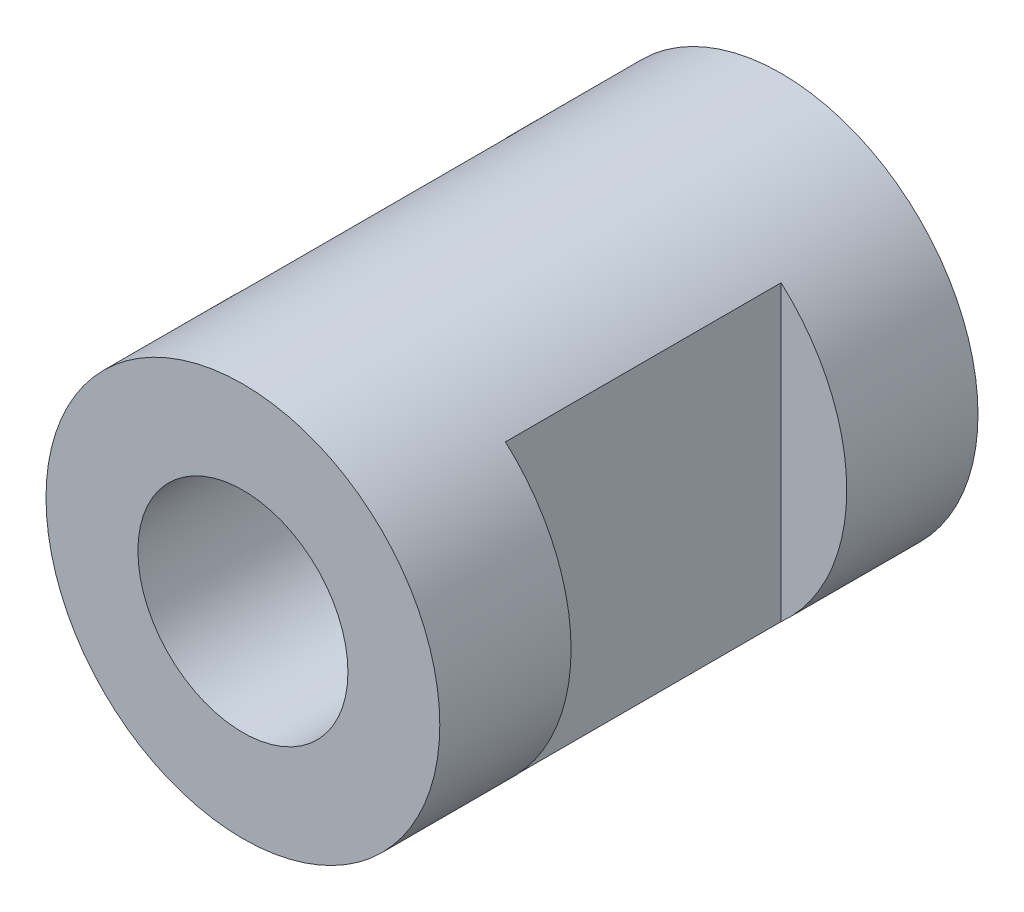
from build123d import *

# Parameters (mm, degrees)
SKETCH_1_R          = 7.5
EXTRUDE_1_DEPTH     = 20.5
SKETCH_2_W          = 4.635677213
SKETCH_2_H          = 10.5
CUT_EXTRUDE_1_DEPTH = 20.5
SKETCH_3_R          = 4
CUT_EXTRUDE_2_DEPTH = 20.5


with BuildPart() as part:
    # Sketch 1 → Extrude 1 (new body)
    with BuildSketch(Plane.XY):
        Circle(SKETCH_1_R)
    extrude(amount=EXTRUDE_1_DEPTH)

    # Sketch 2 → Cut-Extrude 1 (cut)
    with BuildSketch(Plane(origin=(0, 10, 0), x_dir=(-1, 0, 0), z_dir=(0, 1, 0))):
        with Locations((-7.317838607, 10.25)):
            Rectangle(SKETCH_2_W, SKETCH_2_H)
        with Locations((7.317838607, 10.25)):
            Rectangle(SKETCH_2_W, SKETCH_2_H)
    extrude(amount=-CUT_EXTRUDE_1_DEPTH, mode=Mode.SUBTRACT)

    # Sketch 3 → Cut-Extrude 2 (cut)
    with BuildSketch(Plane(origin=(0, 0, 0), x_dir=(-1, 0, 0), z_dir=(0, 0, -1))):
        Circle(SKETCH_3_R)
    extrude(amount=-CUT_EXTRUDE_2_DEPTH, mode=Mode.SUBTRACT)


solid = part.part
